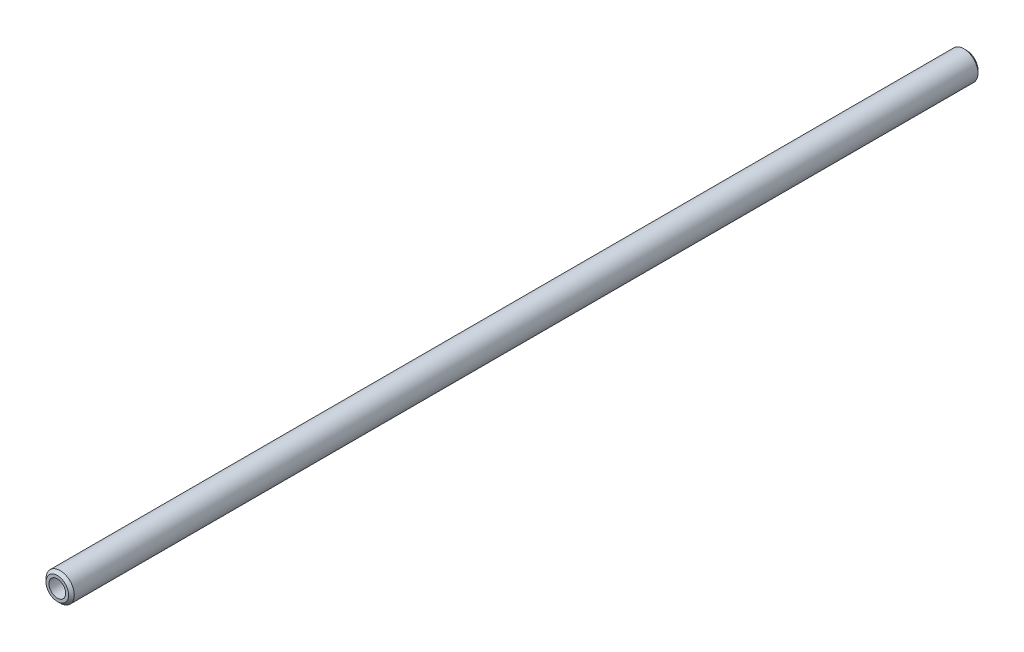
ISO-10303-21;
HEADER;
FILE_DESCRIPTION(('STEP AP214'),'2;1');
FILE_NAME('part.step','',(''),(''),'','','');
FILE_SCHEMA(('AUTOMOTIVE_DESIGN { 1 0 10303 214 1 1 1 1 }'));
ENDSEC;
DATA;
#1=APPLICATION_CONTEXT('core data for automotive mechanical design processes');
#2=APPLICATION_PROTOCOL_DEFINITION('international standard','automotive_design',2000,#1);
#3=PRODUCT_CONTEXT('',#1,'mechanical');
#4=PRODUCT('Part','Part','',(#3));
#5=PRODUCT_RELATED_PRODUCT_CATEGORY('part','',(#4));
#6=PRODUCT_DEFINITION_FORMATION('','',#4);
#7=PRODUCT_DEFINITION_CONTEXT('part definition',#1,'design');
#8=PRODUCT_DEFINITION('design','',#6,#7);
#9=PRODUCT_DEFINITION_SHAPE('','',#8);
#10=(LENGTH_UNIT() NAMED_UNIT(*) SI_UNIT(.MILLI.,.METRE.));
#11=(NAMED_UNIT(*) PLANE_ANGLE_UNIT() SI_UNIT($,.RADIAN.));
#12=(NAMED_UNIT(*) SI_UNIT($,.STERADIAN.) SOLID_ANGLE_UNIT());
#13=UNCERTAINTY_MEASURE_WITH_UNIT(LENGTH_MEASURE(1.E-05),#10,'distance_accuracy_value','');
#14=(GEOMETRIC_REPRESENTATION_CONTEXT(3) GLOBAL_UNCERTAINTY_ASSIGNED_CONTEXT((#13)) GLOBAL_UNIT_ASSIGNED_CONTEXT((#10,
#11,#12)) REPRESENTATION_CONTEXT('',''));
#15=CARTESIAN_POINT('',(0.,0.,0.));
#16=DIRECTION('',(0.,0.,1.));
#17=DIRECTION('',(1.,0.,0.));
#18=AXIS2_PLACEMENT_3D('',#15,#16,#17);
#19=CARTESIAN_POINT('',(0.,0.,96.5));
#20=DIRECTION('',(0.,0.,-1.));
#21=DIRECTION('',(-1.,0.,0.));
#22=AXIS2_PLACEMENT_3D('',#19,#20,#21);
#23=CYLINDRICAL_SURFACE('',#22,1.5);
#24=CARTESIAN_POINT('',(0.,0.,0.299999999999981));
#25=DIRECTION('',(0.,0.,1.));
#26=DIRECTION('',(1.,0.,0.));
#27=AXIS2_PLACEMENT_3D('',#24,#25,#26);
#28=CIRCLE('',#27,1.5);
#29=CARTESIAN_POINT('',(1.5,0.,0.299999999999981));
#30=VERTEX_POINT('',#29);
#31=EDGE_CURVE('E87',#30,#30,#28,.T.);
#32=ORIENTED_EDGE('',*,*,#31,.T.);
#33=EDGE_LOOP('',(#32));
#34=FACE_BOUND('',#33,.T.);
#35=CARTESIAN_POINT('',(0.,0.,96.2));
#36=DIRECTION('',(0.,0.,1.));
#37=DIRECTION('',(1.,0.,0.));
#38=AXIS2_PLACEMENT_3D('',#35,#36,#37);
#39=CIRCLE('',#38,1.5);
#40=CARTESIAN_POINT('',(1.5,0.,96.2));
#41=VERTEX_POINT('',#40);
#42=EDGE_CURVE('E84',#41,#41,#39,.F.);
#43=ORIENTED_EDGE('',*,*,#42,.T.);
#44=EDGE_LOOP('',(#43));
#45=FACE_BOUND('',#44,.T.);
#46=ADVANCED_FACE('F49',(#34,#45),#23,.T.);
#47=CARTESIAN_POINT('',(0.,0.,96.5));
#48=DIRECTION('',(0.,0.,1.));
#49=DIRECTION('',(1.,0.,0.));
#50=AXIS2_PLACEMENT_3D('',#47,#48,#49);
#51=PLANE('',#50);
#52=CARTESIAN_POINT('',(0.,0.,96.5));
#53=DIRECTION('',(0.,0.,1.));
#54=DIRECTION('',(1.,0.,0.));
#55=AXIS2_PLACEMENT_3D('',#52,#53,#54);
#56=CIRCLE('',#55,0.888999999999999);
#57=CARTESIAN_POINT('',(0.888999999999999,0.,96.5));
#58=VERTEX_POINT('',#57);
#59=EDGE_CURVE('E73',#58,#58,#56,.T.);
#60=ORIENTED_EDGE('',*,*,#59,.F.);
#61=EDGE_LOOP('',(#60));
#62=FACE_BOUND('',#61,.T.);
#63=CARTESIAN_POINT('',(0.,0.,96.5));
#64=DIRECTION('',(0.,0.,1.));
#65=DIRECTION('',(1.,0.,0.));
#66=AXIS2_PLACEMENT_3D('',#63,#64,#65);
#67=CIRCLE('',#66,1.20000000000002);
#68=CARTESIAN_POINT('',(1.20000000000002,0.,96.5));
#69=VERTEX_POINT('',#68);
#70=EDGE_CURVE('E13',#69,#69,#67,.T.);
#71=ORIENTED_EDGE('',*,*,#70,.T.);
#72=EDGE_LOOP('',(#71));
#73=FACE_BOUND('',#72,.T.);
#74=ADVANCED_FACE('F101',(#62,#73),#51,.T.);
#75=CARTESIAN_POINT('',(0.,0.,0.));
#76=DIRECTION('',(0.,0.,1.));
#77=DIRECTION('',(1.,0.,0.));
#78=AXIS2_PLACEMENT_3D('',#75,#76,#77);
#79=PLANE('',#78);
#80=CARTESIAN_POINT('',(0.,0.,0.));
#81=DIRECTION('',(0.,0.,-1.));
#82=DIRECTION('',(-1.,0.,0.));
#83=AXIS2_PLACEMENT_3D('',#80,#81,#82);
#84=CIRCLE('',#83,0.888999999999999);
#85=CARTESIAN_POINT('',(-0.888999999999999,0.,0.));
#86=VERTEX_POINT('',#85);
#87=EDGE_CURVE('E74',#86,#86,#84,.T.);
#88=ORIENTED_EDGE('',*,*,#87,.F.);
#89=EDGE_LOOP('',(#88));
#90=FACE_BOUND('',#89,.T.);
#91=CARTESIAN_POINT('',(0.,0.,0.));
#92=DIRECTION('',(0.,0.,1.));
#93=DIRECTION('',(1.,0.,0.));
#94=AXIS2_PLACEMENT_3D('',#91,#92,#93);
#95=CIRCLE('',#94,1.20000000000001);
#96=CARTESIAN_POINT('',(1.20000000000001,0.,0.));
#97=VERTEX_POINT('',#96);
#98=EDGE_CURVE('E57',#97,#97,#95,.F.);
#99=ORIENTED_EDGE('',*,*,#98,.T.);
#100=EDGE_LOOP('',(#99));
#101=FACE_BOUND('',#100,.T.);
#102=ADVANCED_FACE('F92',(#90,#101),#79,.F.);
#103=CARTESIAN_POINT('',(0.,0.,0.299999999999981));
#104=DIRECTION('',(0.,0.,1.));
#105=DIRECTION('',(1.,0.,0.));
#106=AXIS2_PLACEMENT_3D('',#103,#104,#105);
#107=CONICAL_SURFACE('',#106,1.5,0.785398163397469);
#108=ORIENTED_EDGE('',*,*,#98,.F.);
#109=EDGE_LOOP('',(#108));
#110=FACE_BOUND('',#109,.T.);
#111=ORIENTED_EDGE('',*,*,#31,.F.);
#112=EDGE_LOOP('',(#111));
#113=FACE_BOUND('',#112,.T.);
#114=ADVANCED_FACE('F94',(#110,#113),#107,.T.);
#115=CARTESIAN_POINT('',(0.,0.,96.5));
#116=DIRECTION('',(0.,0.,-1.));
#117=DIRECTION('',(-1.,0.,0.));
#118=AXIS2_PLACEMENT_3D('',#115,#116,#117);
#119=CONICAL_SURFACE('',#118,1.20000000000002,0.785398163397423);
#120=ORIENTED_EDGE('',*,*,#42,.F.);
#121=EDGE_LOOP('',(#120));
#122=FACE_BOUND('',#121,.T.);
#123=ORIENTED_EDGE('',*,*,#70,.F.);
#124=EDGE_LOOP('',(#123));
#125=FACE_BOUND('',#124,.T.);
#126=ADVANCED_FACE('F51',(#122,#125),#119,.T.);
#127=CARTESIAN_POINT('',(0.,0.,90.5));
#128=DIRECTION('',(0.,0.,1.));
#129=DIRECTION('',(1.,0.,0.));
#130=AXIS2_PLACEMENT_3D('',#127,#128,#129);
#131=CONICAL_SURFACE('',#130,0.888999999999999,1.02974425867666);
#132=CARTESIAN_POINT('',(0.,0.,89.9658349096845));
#133=VERTEX_POINT('',#132);
#134=VERTEX_LOOP('',#133);
#135=FACE_BOUND('',#134,.T.);
#136=CARTESIAN_POINT('',(0.,0.,90.5));
#137=DIRECTION('',(0.,0.,1.));
#138=DIRECTION('',(1.,0.,0.));
#139=AXIS2_PLACEMENT_3D('',#136,#137,#138);
#140=CIRCLE('',#139,0.888999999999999);
#141=CARTESIAN_POINT('',(0.888999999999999,0.,90.5));
#142=VERTEX_POINT('',#141);
#143=EDGE_CURVE('E77',#142,#142,#140,.T.);
#144=ORIENTED_EDGE('',*,*,#143,.T.);
#145=EDGE_LOOP('',(#144));
#146=FACE_BOUND('',#145,.T.);
#147=ADVANCED_FACE('F107',(#135,#146),#131,.F.);
#148=CARTESIAN_POINT('',(0.,0.,96.5));
#149=DIRECTION('',(0.,0.,1.));
#150=DIRECTION('',(1.,0.,0.));
#151=AXIS2_PLACEMENT_3D('',#148,#149,#150);
#152=CYLINDRICAL_SURFACE('',#151,0.888999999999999);
#153=ORIENTED_EDGE('',*,*,#143,.F.);
#154=EDGE_LOOP('',(#153));
#155=FACE_BOUND('',#154,.T.);
#156=ORIENTED_EDGE('',*,*,#59,.T.);
#157=EDGE_LOOP('',(#156));
#158=FACE_BOUND('',#157,.T.);
#159=ADVANCED_FACE('F67',(#155,#158),#152,.F.);
#160=CARTESIAN_POINT('',(0.,0.,6.));
#161=DIRECTION('',(0.,0.,-1.));
#162=DIRECTION('',(-1.,0.,0.));
#163=AXIS2_PLACEMENT_3D('',#160,#161,#162);
#164=CONICAL_SURFACE('',#163,0.888999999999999,1.02974425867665);
#165=CARTESIAN_POINT('',(0.,0.,6.5341650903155));
#166=VERTEX_POINT('',#165);
#167=VERTEX_LOOP('',#166);
#168=FACE_BOUND('',#167,.T.);
#169=CARTESIAN_POINT('',(0.,0.,6.));
#170=DIRECTION('',(0.,0.,-1.));
#171=DIRECTION('',(-1.,0.,0.));
#172=AXIS2_PLACEMENT_3D('',#169,#170,#171);
#173=CIRCLE('',#172,0.888999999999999);
#174=CARTESIAN_POINT('',(-0.888999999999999,0.,6.));
#175=VERTEX_POINT('',#174);
#176=EDGE_CURVE('E71',#175,#175,#173,.T.);
#177=ORIENTED_EDGE('',*,*,#176,.T.);
#178=EDGE_LOOP('',(#177));
#179=FACE_BOUND('',#178,.T.);
#180=ADVANCED_FACE('F63',(#168,#179),#164,.F.);
#181=CARTESIAN_POINT('',(0.,0.,0.));
#182=DIRECTION('',(0.,0.,-1.));
#183=DIRECTION('',(-1.,0.,0.));
#184=AXIS2_PLACEMENT_3D('',#181,#182,#183);
#185=CYLINDRICAL_SURFACE('',#184,0.888999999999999);
#186=ORIENTED_EDGE('',*,*,#176,.F.);
#187=EDGE_LOOP('',(#186));
#188=FACE_BOUND('',#187,.T.);
#189=ORIENTED_EDGE('',*,*,#87,.T.);
#190=EDGE_LOOP('',(#189));
#191=FACE_BOUND('',#190,.T.);
#192=ADVANCED_FACE('F66',(#188,#191),#185,.F.);
#193=CLOSED_SHELL('',(#46,#74,#102,#114,#126,#147,#159,#180,#192));
#194=MANIFOLD_SOLID_BREP('B2',#193);
#195=ADVANCED_BREP_SHAPE_REPRESENTATION('',(#18,#194),#14);
#196=SHAPE_DEFINITION_REPRESENTATION(#9,#195);
ENDSEC;
END-ISO-10303-21;
